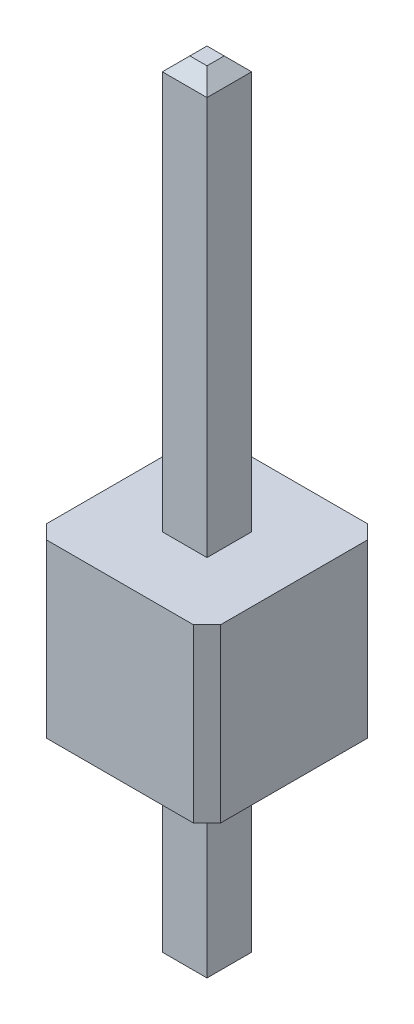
from build123d import *

# Parameters (mm, degrees)
SKETCH1_W                = 2.54
SKETCH1_H                = 2.54
BOSS_EXTRUDE1_DEPTH      = 2.5
BOSS_EXTRUDE2_DEPTH      = 6
BOSS_EXTRUDE2_DEPTH_BACK = 5.5
SKETCH2_W                = 0.65
SKETCH2_H                = 0.65
CHAMFER1_SIZE            = 0.2
CHAMFER2_SIZE            = 0.2


with BuildPart() as part:
    # Sketch1 → Boss-Extrude1 (new body)
    with BuildSketch(Plane(origin=(0, 0, 0), x_dir=(1, 0, 0), z_dir=(0, 1, 0))):
        Rectangle(SKETCH1_W, SKETCH1_H)
    extrude(amount=BOSS_EXTRUDE1_DEPTH)

    # Sketch2 → Boss-Extrude2 (add, two sides: drawn at the far end of the back side and taken through both)
    with BuildSketch(Plane(origin=(0, 2.5, 0), x_dir=(1, 0, 0), z_dir=(0, 1, 0)).offset(-BOSS_EXTRUDE2_DEPTH_BACK)):
        Rectangle(SKETCH2_W, SKETCH2_H)
    extrude(amount=BOSS_EXTRUDE2_DEPTH + BOSS_EXTRUDE2_DEPTH_BACK)

    # Chamfer1
    chamfer1_edges = [part.edges().sort_by_distance(p)[0] for p in [
        (1.27, 1.25, 1.27),
        (-1.27, 1.25, 1.27),
        (-1.27, 1.25, -1.27),
        (1.27, 1.25, -1.27),
    ]]
    chamfer(chamfer1_edges, length=CHAMFER1_SIZE)

    # Chamfer2
    chamfer2_edges = [part.edges().sort_by_distance(p)[0] for p in [
        (0.325, -3, 0),
        (0, -3, 0.325),
        (-0.325, -3, 0),
        (0, -3, -0.325),
        (0.325, 8.5, 0),
        (0, 8.5, -0.325),
        (-0.325, 8.5, 0),
        (0, 8.5, 0.325),
    ]]
    chamfer(chamfer2_edges, length=CHAMFER2_SIZE)


solid = part.part
